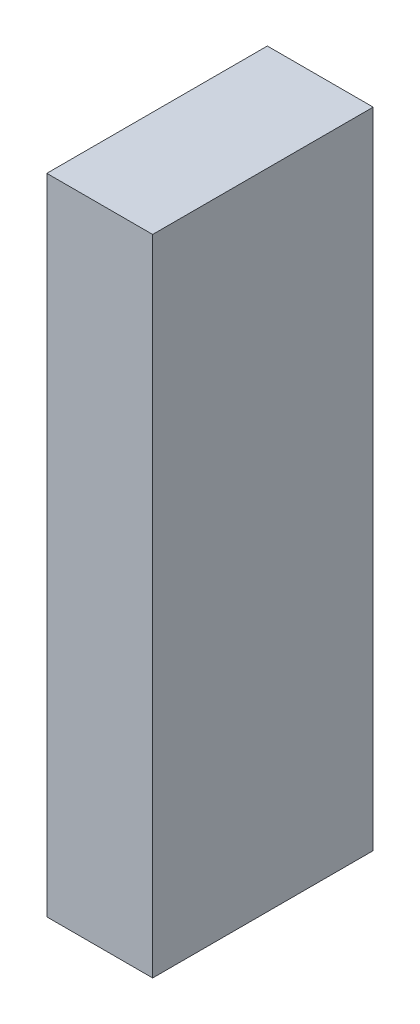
ISO-10303-21;
HEADER;
FILE_DESCRIPTION(('STEP AP214'),'2;1');
FILE_NAME('part.step','',(''),(''),'','','');
FILE_SCHEMA(('AUTOMOTIVE_DESIGN { 1 0 10303 214 1 1 1 1 }'));
ENDSEC;
DATA;
#1=APPLICATION_CONTEXT('core data for automotive mechanical design processes');
#2=APPLICATION_PROTOCOL_DEFINITION('international standard','automotive_design',2000,#1);
#3=PRODUCT_CONTEXT('',#1,'mechanical');
#4=PRODUCT('Part','Part','',(#3));
#5=PRODUCT_RELATED_PRODUCT_CATEGORY('part','',(#4));
#6=PRODUCT_DEFINITION_FORMATION('','',#4);
#7=PRODUCT_DEFINITION_CONTEXT('part definition',#1,'design');
#8=PRODUCT_DEFINITION('design','',#6,#7);
#9=PRODUCT_DEFINITION_SHAPE('','',#8);
#10=(LENGTH_UNIT() NAMED_UNIT(*) SI_UNIT(.MILLI.,.METRE.));
#11=(NAMED_UNIT(*) PLANE_ANGLE_UNIT() SI_UNIT($,.RADIAN.));
#12=(NAMED_UNIT(*) SI_UNIT($,.STERADIAN.) SOLID_ANGLE_UNIT());
#13=UNCERTAINTY_MEASURE_WITH_UNIT(LENGTH_MEASURE(1.E-05),#10,'distance_accuracy_value','');
#14=(GEOMETRIC_REPRESENTATION_CONTEXT(3) GLOBAL_UNCERTAINTY_ASSIGNED_CONTEXT((#13)) GLOBAL_UNIT_ASSIGNED_CONTEXT((#10,
#11,#12)) REPRESENTATION_CONTEXT('',''));
#15=CARTESIAN_POINT('',(0.,0.,0.));
#16=DIRECTION('',(0.,0.,1.));
#17=DIRECTION('',(1.,0.,0.));
#18=AXIS2_PLACEMENT_3D('',#15,#16,#17);
#19=CARTESIAN_POINT('',(24.,-73.,50.));
#20=DIRECTION('',(0.,1.,0.));
#21=DIRECTION('',(-1.,0.,0.));
#22=AXIS2_PLACEMENT_3D('',#19,#20,#21);
#23=PLANE('',#22);
#24=DIRECTION('',(0.,0.,-1.));
#25=VECTOR('',#24,1.);
#26=CARTESIAN_POINT('',(0.,-73.,50.));
#27=LINE('',#26,#25);
#28=CARTESIAN_POINT('',(0.,-73.,50.));
#29=VERTEX_POINT('',#28);
#30=CARTESIAN_POINT('',(0.,-73.,0.));
#31=VERTEX_POINT('',#30);
#32=EDGE_CURVE('E154',#29,#31,#27,.T.);
#33=ORIENTED_EDGE('',*,*,#32,.T.);
#34=DIRECTION('',(-1.,0.,0.));
#35=VECTOR('',#34,1.);
#36=CARTESIAN_POINT('',(24.,-73.,0.));
#37=LINE('',#36,#35);
#38=CARTESIAN_POINT('',(24.,-73.,0.));
#39=VERTEX_POINT('',#38);
#40=EDGE_CURVE('E9',#39,#31,#37,.T.);
#41=ORIENTED_EDGE('',*,*,#40,.F.);
#42=DIRECTION('',(0.,0.,-1.));
#43=VECTOR('',#42,1.);
#44=CARTESIAN_POINT('',(24.,-73.,50.));
#45=LINE('',#44,#43);
#46=CARTESIAN_POINT('',(24.,-73.,50.));
#47=VERTEX_POINT('',#46);
#48=EDGE_CURVE('E195',#47,#39,#45,.T.);
#49=ORIENTED_EDGE('',*,*,#48,.F.);
#50=DIRECTION('',(-1.,0.,0.));
#51=VECTOR('',#50,1.);
#52=CARTESIAN_POINT('',(24.,-73.,50.));
#53=LINE('',#52,#51);
#54=EDGE_CURVE('E204',#47,#29,#53,.T.);
#55=ORIENTED_EDGE('',*,*,#54,.T.);
#56=EDGE_LOOP('',(#33,#41,#49,#55));
#57=FACE_BOUND('',#56,.T.);
#58=ADVANCED_FACE('F14',(#57),#23,.F.);
#59=CARTESIAN_POINT('',(24.,-73.,0.));
#60=DIRECTION('',(0.,0.,1.));
#61=DIRECTION('',(1.,0.,0.));
#62=AXIS2_PLACEMENT_3D('',#59,#60,#61);
#63=PLANE('',#62);
#64=DIRECTION('',(0.,1.,0.));
#65=VECTOR('',#64,1.);
#66=CARTESIAN_POINT('',(0.,-73.,0.));
#67=LINE('',#66,#65);
#68=CARTESIAN_POINT('',(0.,-35.,0.));
#69=VERTEX_POINT('',#68);
#70=EDGE_CURVE('E175',#31,#69,#67,.T.);
#71=ORIENTED_EDGE('',*,*,#70,.T.);
#72=DIRECTION('',(1.,0.,0.));
#73=VECTOR('',#72,1.);
#74=CARTESIAN_POINT('',(-6.,-35.,0.));
#75=LINE('',#74,#73);
#76=CARTESIAN_POINT('',(-6.,-35.,0.));
#77=VERTEX_POINT('',#76);
#78=EDGE_CURVE('E112',#77,#69,#75,.T.);
#79=ORIENTED_EDGE('',*,*,#78,.F.);
#80=DIRECTION('',(0.,1.,0.));
#81=VECTOR('',#80,1.);
#82=CARTESIAN_POINT('',(-6.,-35.,0.));
#83=LINE('',#82,#81);
#84=CARTESIAN_POINT('',(-6.,-25.9,0.));
#85=VERTEX_POINT('',#84);
#86=EDGE_CURVE('E135',#77,#85,#83,.T.);
#87=ORIENTED_EDGE('',*,*,#86,.T.);
#88=DIRECTION('',(1.,0.,0.));
#89=VECTOR('',#88,1.);
#90=CARTESIAN_POINT('',(-6.,-25.9,0.));
#91=LINE('',#90,#89);
#92=CARTESIAN_POINT('',(0.,-25.9,0.));
#93=VERTEX_POINT('',#92);
#94=EDGE_CURVE('E160',#85,#93,#91,.T.);
#95=ORIENTED_EDGE('',*,*,#94,.T.);
#96=CARTESIAN_POINT('',(0.,25.9,0.));
#97=VERTEX_POINT('',#96);
#98=EDGE_CURVE('E176',#93,#97,#67,.T.);
#99=ORIENTED_EDGE('',*,*,#98,.T.);
#100=DIRECTION('',(1.,0.,0.));
#101=VECTOR('',#100,1.);
#102=CARTESIAN_POINT('',(-6.,25.9,0.));
#103=LINE('',#102,#101);
#104=CARTESIAN_POINT('',(-6.,25.9,0.));
#105=VERTEX_POINT('',#104);
#106=EDGE_CURVE('E158',#105,#97,#103,.T.);
#107=ORIENTED_EDGE('',*,*,#106,.F.);
#108=DIRECTION('',(0.,1.,0.));
#109=VECTOR('',#108,1.);
#110=CARTESIAN_POINT('',(-6.,25.9,0.));
#111=LINE('',#110,#109);
#112=CARTESIAN_POINT('',(-6.,34.9999999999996,0.));
#113=VERTEX_POINT('',#112);
#114=EDGE_CURVE('E147',#105,#113,#111,.T.);
#115=ORIENTED_EDGE('',*,*,#114,.T.);
#116=DIRECTION('',(1.,0.,0.));
#117=VECTOR('',#116,1.);
#118=CARTESIAN_POINT('',(-6.,34.9999999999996,0.));
#119=LINE('',#118,#117);
#120=CARTESIAN_POINT('',(0.,34.9999999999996,0.));
#121=VERTEX_POINT('',#120);
#122=EDGE_CURVE('E155',#113,#121,#119,.T.);
#123=ORIENTED_EDGE('',*,*,#122,.T.);
#124=CARTESIAN_POINT('',(0.,73.,0.));
#125=VERTEX_POINT('',#124);
#126=EDGE_CURVE('E164',#121,#125,#67,.T.);
#127=ORIENTED_EDGE('',*,*,#126,.T.);
#128=DIRECTION('',(-1.,0.,0.));
#129=VECTOR('',#128,1.);
#130=CARTESIAN_POINT('',(24.,73.,0.));
#131=LINE('',#130,#129);
#132=CARTESIAN_POINT('',(24.,73.,0.));
#133=VERTEX_POINT('',#132);
#134=EDGE_CURVE('E23',#133,#125,#131,.T.);
#135=ORIENTED_EDGE('',*,*,#134,.F.);
#136=DIRECTION('',(0.,1.,0.));
#137=VECTOR('',#136,1.);
#138=CARTESIAN_POINT('',(24.,-73.,0.));
#139=LINE('',#138,#137);
#140=EDGE_CURVE('E198',#39,#133,#139,.T.);
#141=ORIENTED_EDGE('',*,*,#140,.F.);
#142=ORIENTED_EDGE('',*,*,#40,.T.);
#143=EDGE_LOOP('',(#71,#79,#87,#95,#99,#107,#115,#123,#127,#135,#141,#142));
#144=FACE_BOUND('',#143,.T.);
#145=ADVANCED_FACE('F183',(#144),#63,.F.);
#146=CARTESIAN_POINT('',(24.,73.,0.));
#147=DIRECTION('',(0.,-1.,0.));
#148=DIRECTION('',(1.,0.,0.));
#149=AXIS2_PLACEMENT_3D('',#146,#147,#148);
#150=PLANE('',#149);
#151=DIRECTION('',(0.,0.,1.));
#152=VECTOR('',#151,1.);
#153=CARTESIAN_POINT('',(0.,73.,0.));
#154=LINE('',#153,#152);
#155=CARTESIAN_POINT('',(0.,73.,50.));
#156=VERTEX_POINT('',#155);
#157=EDGE_CURVE('E167',#125,#156,#154,.T.);
#158=ORIENTED_EDGE('',*,*,#157,.T.);
#159=DIRECTION('',(-1.,0.,0.));
#160=VECTOR('',#159,1.);
#161=CARTESIAN_POINT('',(24.,73.,50.));
#162=LINE('',#161,#160);
#163=CARTESIAN_POINT('',(24.,73.,50.));
#164=VERTEX_POINT('',#163);
#165=EDGE_CURVE('E191',#164,#156,#162,.T.);
#166=ORIENTED_EDGE('',*,*,#165,.F.);
#167=DIRECTION('',(0.,0.,1.));
#168=VECTOR('',#167,1.);
#169=CARTESIAN_POINT('',(24.,73.,0.));
#170=LINE('',#169,#168);
#171=EDGE_CURVE('E190',#133,#164,#170,.T.);
#172=ORIENTED_EDGE('',*,*,#171,.F.);
#173=ORIENTED_EDGE('',*,*,#134,.T.);
#174=EDGE_LOOP('',(#158,#166,#172,#173));
#175=FACE_BOUND('',#174,.T.);
#176=ADVANCED_FACE('F187',(#175),#150,.F.);
#177=CARTESIAN_POINT('',(24.,73.,50.));
#178=DIRECTION('',(0.,0.,-1.));
#179=DIRECTION('',(-1.,0.,0.));
#180=AXIS2_PLACEMENT_3D('',#177,#178,#179);
#181=PLANE('',#180);
#182=DIRECTION('',(0.,-1.,0.));
#183=VECTOR('',#182,1.);
#184=CARTESIAN_POINT('',(0.,73.,50.));
#185=LINE('',#184,#183);
#186=EDGE_CURVE('E194',#156,#29,#185,.T.);
#187=ORIENTED_EDGE('',*,*,#186,.T.);
#188=ORIENTED_EDGE('',*,*,#54,.F.);
#189=DIRECTION('',(0.,-1.,0.));
#190=VECTOR('',#189,1.);
#191=CARTESIAN_POINT('',(24.,73.,50.));
#192=LINE('',#191,#190);
#193=EDGE_CURVE('E39',#164,#47,#192,.T.);
#194=ORIENTED_EDGE('',*,*,#193,.F.);
#195=ORIENTED_EDGE('',*,*,#165,.T.);
#196=EDGE_LOOP('',(#187,#188,#194,#195));
#197=FACE_BOUND('',#196,.T.);
#198=ADVANCED_FACE('F206',(#197),#181,.F.);
#199=CARTESIAN_POINT('',(24.,-73.,0.));
#200=DIRECTION('',(1.,0.,0.));
#201=DIRECTION('',(0.,1.,0.));
#202=AXIS2_PLACEMENT_3D('',#199,#200,#201);
#203=PLANE('',#202);
#204=ORIENTED_EDGE('',*,*,#48,.T.);
#205=ORIENTED_EDGE('',*,*,#140,.T.);
#206=ORIENTED_EDGE('',*,*,#171,.T.);
#207=ORIENTED_EDGE('',*,*,#193,.T.);
#208=EDGE_LOOP('',(#204,#205,#206,#207));
#209=FACE_BOUND('',#208,.T.);
#210=ADVANCED_FACE('F210',(#209),#203,.T.);
#211=CARTESIAN_POINT('',(0.,-73.,0.));
#212=DIRECTION('',(1.,0.,0.));
#213=DIRECTION('',(0.,1.,0.));
#214=AXIS2_PLACEMENT_3D('',#211,#212,#213);
#215=PLANE('',#214);
#216=DIRECTION('',(0.,-1.,0.));
#217=VECTOR('',#216,1.);
#218=CARTESIAN_POINT('',(0.,-35.,7.69999999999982));
#219=LINE('',#218,#217);
#220=CARTESIAN_POINT('',(0.,35.,7.69999999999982));
#221=VERTEX_POINT('',#220);
#222=CARTESIAN_POINT('',(0.,-35.,7.69999999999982));
#223=VERTEX_POINT('',#222);
#224=EDGE_CURVE('E31',#221,#223,#219,.T.);
#225=ORIENTED_EDGE('',*,*,#224,.T.);
#226=DIRECTION('',(0.,0.,-1.));
#227=VECTOR('',#226,1.);
#228=CARTESIAN_POINT('',(0.,-35.,0.));
#229=LINE('',#228,#227);
#230=EDGE_CURVE('E17',#223,#69,#229,.T.);
#231=ORIENTED_EDGE('',*,*,#230,.T.);
#232=ORIENTED_EDGE('',*,*,#70,.F.);
#233=ORIENTED_EDGE('',*,*,#32,.F.);
#234=ORIENTED_EDGE('',*,*,#186,.F.);
#235=ORIENTED_EDGE('',*,*,#157,.F.);
#236=ORIENTED_EDGE('',*,*,#126,.F.);
#237=DIRECTION('',(0.,0.,1.));
#238=VECTOR('',#237,1.);
#239=CARTESIAN_POINT('',(0.,35.,7.69999999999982));
#240=LINE('',#239,#238);
#241=EDGE_CURVE('E124',#121,#221,#240,.T.);
#242=ORIENTED_EDGE('',*,*,#241,.T.);
#243=EDGE_LOOP('',(#225,#231,#232,#233,#234,#235,#236,#242));
#244=FACE_BOUND('',#243,.T.);
#245=ADVANCED_FACE('F121',(#244),#215,.F.);
#246=CARTESIAN_POINT('',(0.,25.9,7.69999999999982));
#247=DIRECTION('',(1.,0.,0.));
#248=DIRECTION('',(0.,1.,0.));
#249=AXIS2_PLACEMENT_3D('',#246,#247,#248);
#250=PLANE('',#249);
#251=ORIENTED_EDGE('',*,*,#98,.F.);
#252=DIRECTION('',(0.,0.,-1.));
#253=VECTOR('',#252,1.);
#254=CARTESIAN_POINT('',(0.,-25.9,0.));
#255=LINE('',#254,#253);
#256=CARTESIAN_POINT('',(0.,-25.9,-7.30000000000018));
#257=VERTEX_POINT('',#256);
#258=EDGE_CURVE('E119',#93,#257,#255,.T.);
#259=ORIENTED_EDGE('',*,*,#258,.T.);
#260=DIRECTION('',(0.,1.,0.));
#261=VECTOR('',#260,1.);
#262=CARTESIAN_POINT('',(0.,-25.9,-7.30000000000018));
#263=LINE('',#262,#261);
#264=CARTESIAN_POINT('',(0.,25.9,-7.30000000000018));
#265=VERTEX_POINT('',#264);
#266=EDGE_CURVE('E128',#257,#265,#263,.T.);
#267=ORIENTED_EDGE('',*,*,#266,.T.);
#268=DIRECTION('',(0.,0.,1.));
#269=VECTOR('',#268,1.);
#270=CARTESIAN_POINT('',(0.,25.9,-7.30000000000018));
#271=LINE('',#270,#269);
#272=EDGE_CURVE('E131',#265,#97,#271,.T.);
#273=ORIENTED_EDGE('',*,*,#272,.T.);
#274=EDGE_LOOP('',(#251,#259,#267,#273));
#275=FACE_BOUND('',#274,.T.);
#276=ADVANCED_FACE('F234',(#275),#250,.T.);
#277=CARTESIAN_POINT('',(-6.,-35.,7.69999999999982));
#278=DIRECTION('',(0.,0.,1.));
#279=DIRECTION('',(1.,0.,0.));
#280=AXIS2_PLACEMENT_3D('',#277,#278,#279);
#281=PLANE('',#280);
#282=ORIENTED_EDGE('',*,*,#224,.F.);
#283=DIRECTION('',(1.,0.,0.));
#284=VECTOR('',#283,1.);
#285=CARTESIAN_POINT('',(-6.,35.,7.69999999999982));
#286=LINE('',#285,#284);
#287=CARTESIAN_POINT('',(-6.,35.,7.69999999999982));
#288=VERTEX_POINT('',#287);
#289=EDGE_CURVE('E152',#288,#221,#286,.T.);
#290=ORIENTED_EDGE('',*,*,#289,.F.);
#291=DIRECTION('',(0.,-1.,0.));
#292=VECTOR('',#291,1.);
#293=CARTESIAN_POINT('',(-6.,-35.,7.69999999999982));
#294=LINE('',#293,#292);
#295=CARTESIAN_POINT('',(-6.,-35.,7.69999999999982));
#296=VERTEX_POINT('',#295);
#297=EDGE_CURVE('E108',#288,#296,#294,.T.);
#298=ORIENTED_EDGE('',*,*,#297,.T.);
#299=DIRECTION('',(1.,0.,0.));
#300=VECTOR('',#299,1.);
#301=CARTESIAN_POINT('',(-6.,-35.,7.69999999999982));
#302=LINE('',#301,#300);
#303=EDGE_CURVE('E104',#296,#223,#302,.T.);
#304=ORIENTED_EDGE('',*,*,#303,.T.);
#305=EDGE_LOOP('',(#282,#290,#298,#304));
#306=FACE_BOUND('',#305,.T.);
#307=ADVANCED_FACE('F106',(#306),#281,.T.);
#308=CARTESIAN_POINT('',(-6.,35.,7.69999999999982));
#309=DIRECTION('',(0.,1.,0.));
#310=DIRECTION('',(0.,0.,1.));
#311=AXIS2_PLACEMENT_3D('',#308,#309,#310);
#312=PLANE('',#311);
#313=ORIENTED_EDGE('',*,*,#241,.F.);
#314=ORIENTED_EDGE('',*,*,#122,.F.);
#315=DIRECTION('',(0.,0.,1.));
#316=VECTOR('',#315,1.);
#317=CARTESIAN_POINT('',(-6.,35.,7.69999999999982));
#318=LINE('',#317,#316);
#319=EDGE_CURVE('E113',#113,#288,#318,.T.);
#320=ORIENTED_EDGE('',*,*,#319,.T.);
#321=ORIENTED_EDGE('',*,*,#289,.T.);
#322=EDGE_LOOP('',(#313,#314,#320,#321));
#323=FACE_BOUND('',#322,.T.);
#324=ADVANCED_FACE('F250',(#323),#312,.T.);
#325=CARTESIAN_POINT('',(-6.,25.9,-7.30000000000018));
#326=DIRECTION('',(0.,1.,0.));
#327=DIRECTION('',(-1.,0.,0.));
#328=AXIS2_PLACEMENT_3D('',#325,#326,#327);
#329=PLANE('',#328);
#330=ORIENTED_EDGE('',*,*,#272,.F.);
#331=DIRECTION('',(1.,0.,0.));
#332=VECTOR('',#331,1.);
#333=CARTESIAN_POINT('',(-6.,25.9,-7.30000000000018));
#334=LINE('',#333,#332);
#335=CARTESIAN_POINT('',(-6.,25.9,-7.30000000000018));
#336=VERTEX_POINT('',#335);
#337=EDGE_CURVE('E156',#336,#265,#334,.T.);
#338=ORIENTED_EDGE('',*,*,#337,.F.);
#339=DIRECTION('',(0.,0.,1.));
#340=VECTOR('',#339,1.);
#341=CARTESIAN_POINT('',(-6.,25.9,-7.30000000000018));
#342=LINE('',#341,#340);
#343=EDGE_CURVE('E144',#336,#105,#342,.T.);
#344=ORIENTED_EDGE('',*,*,#343,.T.);
#345=ORIENTED_EDGE('',*,*,#106,.T.);
#346=EDGE_LOOP('',(#330,#338,#344,#345));
#347=FACE_BOUND('',#346,.T.);
#348=ADVANCED_FACE('F246',(#347),#329,.T.);
#349=CARTESIAN_POINT('',(-6.,-25.9,-7.30000000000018));
#350=DIRECTION('',(0.,0.,-1.));
#351=DIRECTION('',(-1.,0.,0.));
#352=AXIS2_PLACEMENT_3D('',#349,#350,#351);
#353=PLANE('',#352);
#354=ORIENTED_EDGE('',*,*,#266,.F.);
#355=DIRECTION('',(1.,0.,0.));
#356=VECTOR('',#355,1.);
#357=CARTESIAN_POINT('',(-6.,-25.9,-7.30000000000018));
#358=LINE('',#357,#356);
#359=CARTESIAN_POINT('',(-6.,-25.9,-7.30000000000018));
#360=VERTEX_POINT('',#359);
#361=EDGE_CURVE('E159',#360,#257,#358,.T.);
#362=ORIENTED_EDGE('',*,*,#361,.F.);
#363=DIRECTION('',(0.,1.,0.));
#364=VECTOR('',#363,1.);
#365=CARTESIAN_POINT('',(-6.,-25.9,-7.30000000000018));
#366=LINE('',#365,#364);
#367=EDGE_CURVE('E141',#360,#336,#366,.T.);
#368=ORIENTED_EDGE('',*,*,#367,.T.);
#369=ORIENTED_EDGE('',*,*,#337,.T.);
#370=EDGE_LOOP('',(#354,#362,#368,#369));
#371=FACE_BOUND('',#370,.T.);
#372=ADVANCED_FACE('F259',(#371),#353,.T.);
#373=CARTESIAN_POINT('',(-6.,-25.9,0.));
#374=DIRECTION('',(0.,-1.,0.));
#375=DIRECTION('',(1.,0.,0.));
#376=AXIS2_PLACEMENT_3D('',#373,#374,#375);
#377=PLANE('',#376);
#378=ORIENTED_EDGE('',*,*,#258,.F.);
#379=ORIENTED_EDGE('',*,*,#94,.F.);
#380=DIRECTION('',(0.,0.,-1.));
#381=VECTOR('',#380,1.);
#382=CARTESIAN_POINT('',(-6.,-25.9,0.));
#383=LINE('',#382,#381);
#384=EDGE_CURVE('E138',#85,#360,#383,.T.);
#385=ORIENTED_EDGE('',*,*,#384,.T.);
#386=ORIENTED_EDGE('',*,*,#361,.T.);
#387=EDGE_LOOP('',(#378,#379,#385,#386));
#388=FACE_BOUND('',#387,.T.);
#389=ADVANCED_FACE('F220',(#388),#377,.T.);
#390=CARTESIAN_POINT('',(-6.,-35.,0.));
#391=DIRECTION('',(0.,-1.,0.));
#392=DIRECTION('',(1.,0.,0.));
#393=AXIS2_PLACEMENT_3D('',#390,#391,#392);
#394=PLANE('',#393);
#395=ORIENTED_EDGE('',*,*,#230,.F.);
#396=ORIENTED_EDGE('',*,*,#303,.F.);
#397=DIRECTION('',(0.,0.,-1.));
#398=VECTOR('',#397,1.);
#399=CARTESIAN_POINT('',(-6.,-35.,0.));
#400=LINE('',#399,#398);
#401=EDGE_CURVE('E133',#296,#77,#400,.T.);
#402=ORIENTED_EDGE('',*,*,#401,.T.);
#403=ORIENTED_EDGE('',*,*,#78,.T.);
#404=EDGE_LOOP('',(#395,#396,#402,#403));
#405=FACE_BOUND('',#404,.T.);
#406=ADVANCED_FACE('F116',(#405),#394,.T.);
#407=CARTESIAN_POINT('',(-6.,25.9,7.69999999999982));
#408=DIRECTION('',(1.,0.,0.));
#409=DIRECTION('',(0.,1.,0.));
#410=AXIS2_PLACEMENT_3D('',#407,#408,#409);
#411=PLANE('',#410);
#412=ORIENTED_EDGE('',*,*,#297,.F.);
#413=ORIENTED_EDGE('',*,*,#319,.F.);
#414=ORIENTED_EDGE('',*,*,#114,.F.);
#415=ORIENTED_EDGE('',*,*,#343,.F.);
#416=ORIENTED_EDGE('',*,*,#367,.F.);
#417=ORIENTED_EDGE('',*,*,#384,.F.);
#418=ORIENTED_EDGE('',*,*,#86,.F.);
#419=ORIENTED_EDGE('',*,*,#401,.F.);
#420=EDGE_LOOP('',(#412,#413,#414,#415,#416,#417,#418,#419));
#421=FACE_BOUND('',#420,.T.);
#422=ADVANCED_FACE('F215',(#421),#411,.F.);
#423=CLOSED_SHELL('',(#58,#145,#176,#198,#210,#245,#276,#307,#324,#348,#372,#389,#406,#422));
#424=MANIFOLD_SOLID_BREP('B1',#423);
#425=ADVANCED_BREP_SHAPE_REPRESENTATION('',(#18,#424),#14);
#426=SHAPE_DEFINITION_REPRESENTATION(#9,#425);
ENDSEC;
END-ISO-10303-21;
